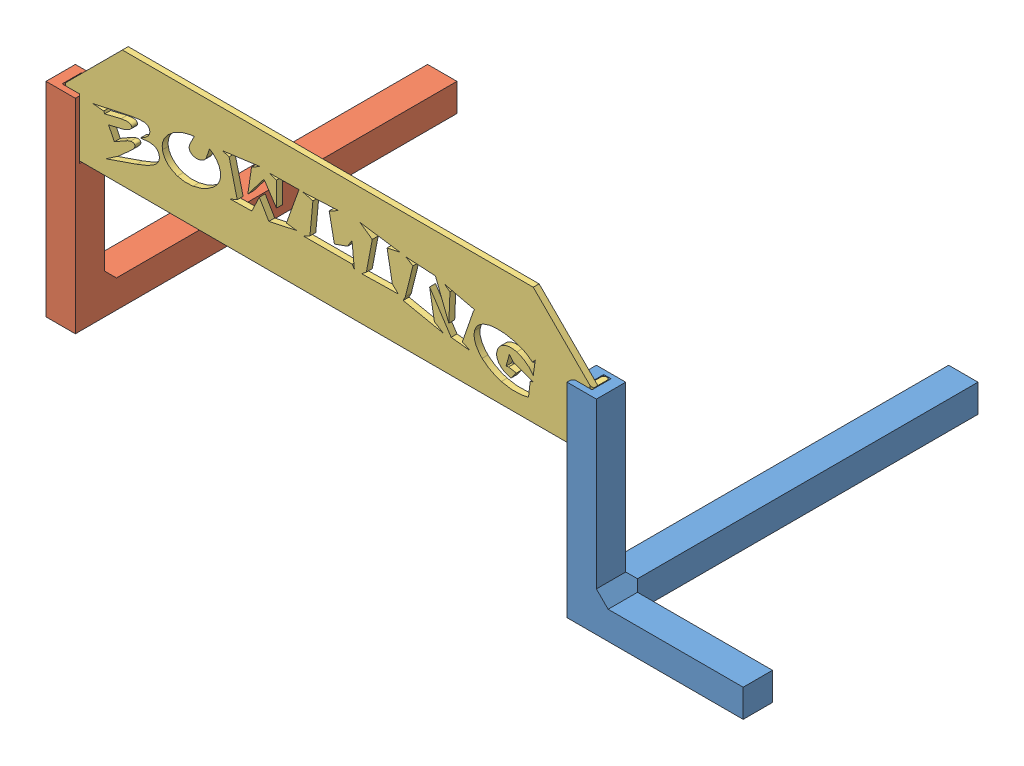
SolidWorks assembly Portique Bowling.SLDASM, configuration Défaut (file format 13000). Lengths in mm.
Overall size (237.5 90 130).
3 component instances, 3 part files, 6 mates.
Components (placement in the parent):
- Portique gauche-1: Portique gauche.SLDPRT [Défaut] at (-24.2824 -24.6101 195) size (60 70 130)
- Portique droit-1: Portique droit.SLDPRT [Défaut] at (-201.7824 -24.6101 195) size (10 70 130)
- Bowling-1: Bowling.SLDPRT [Défaut] at (-118.0324 25.3899 190.75) size (180 40 6)
Mates (geometry in assembly coordinates):
- Coïncidente1: coincident aligned: plane of Portique gauche-1 through (-34.2824 -24.6101 65) normal (0 -1 0); plane of Portique droit-1 through (-211.7824 -24.6101 65) normal (0 -1 0)
- Coïncidente2: coincident aligned: plane of Portique gauche-1 through (-34.2824 -14.6101 65) normal (0 0 -1); plane of Portique droit-1 through (-211.7824 -14.6101 65) normal (0 0 -1)
- Distance1: distance = 0.25 mm anti-aligned: plane of Bowling-1 through (-28.0324 25.3899 192.75) normal (1 0 0); plane of Portique gauche-1 through (-27.7824 25.3899 193) normal (-1 0 0)
- Distance2: distance = 0.25 mm anti-aligned: plane of Bowling-1 through (-118.0324 25.3899 192.75) normal (0 0 1); plane of Portique gauche-1 through (-34.2824 25.3899 193) normal (0 0 -1)
- Coïncidente5: coincident anti-aligned: plane of Portique gauche-1 through (-24.2824 25.3899 195) normal (0 1 0); plane of Bowling-1 through (-208.0324 25.3899 192.75) normal (0 -1 0)
- Distance3: distance = 0.25 mm anti-aligned: plane of Portique droit-1 through (-208.2824 25.3899 193) normal (1 0 0); plane of Bowling-1 through (-208.0324 45.3899 192.75) normal (-1 0 0)
